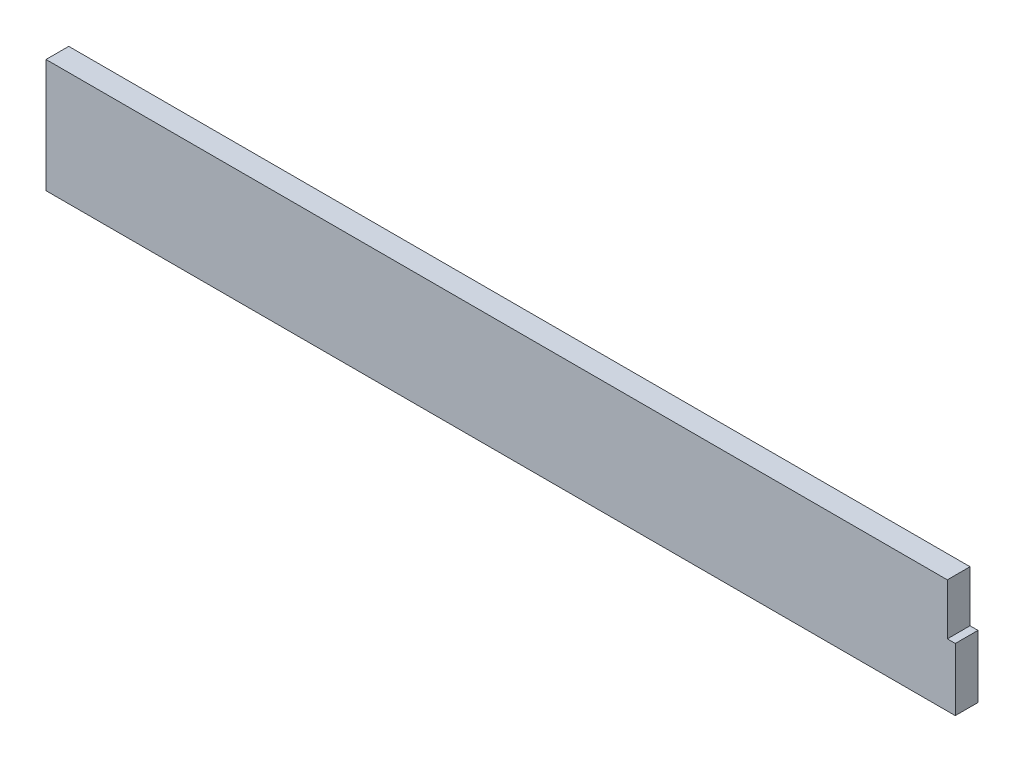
from build123d import *

# Parameters (mm, degrees)
EXTRUDE_1_DEPTH = 2


with BuildPart() as part:
    # Sketch 1 → Extrude 1 (new body)
    with BuildSketch(Plane.XY):
        Polygon((0, 0), (80, 0), (80, 5.5), (79.3, 5.5), (79.3, 10), (0, 10), align=None)
    extrude(amount=EXTRUDE_1_DEPTH)


solid = part.part
